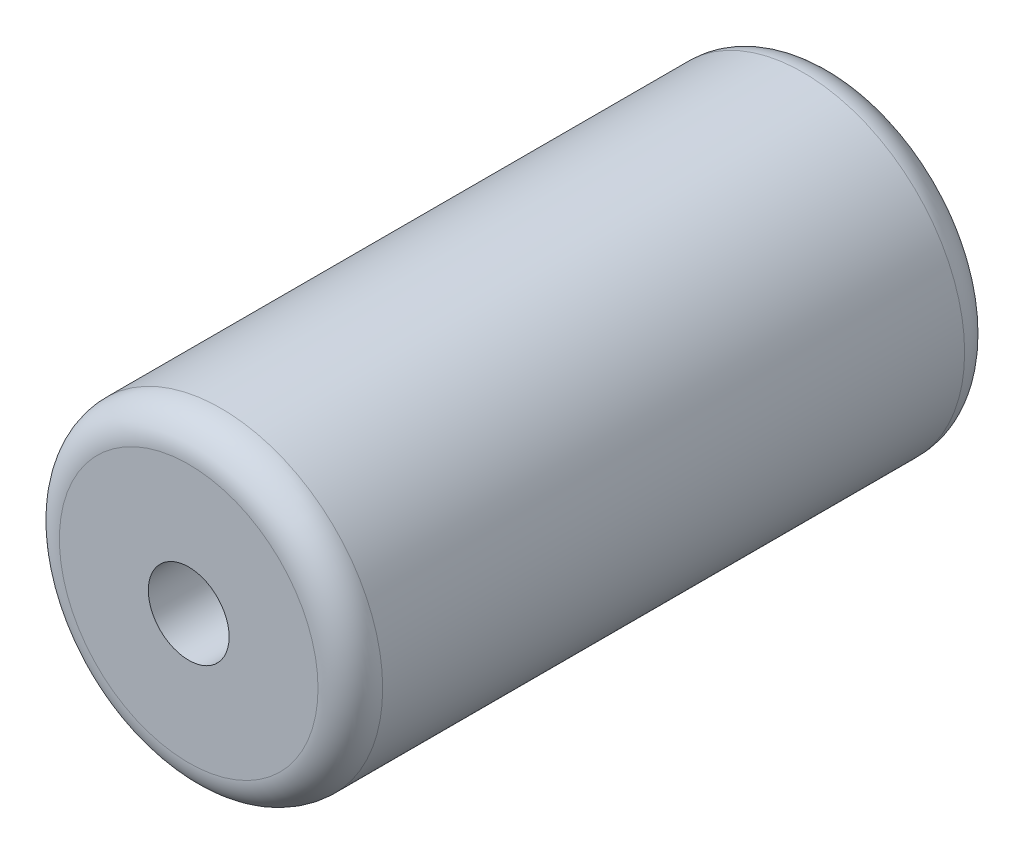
ISO-10303-21;
HEADER;
FILE_DESCRIPTION(('STEP AP214'),'2;1');
FILE_NAME('part.step','',(''),(''),'','','');
FILE_SCHEMA(('AUTOMOTIVE_DESIGN { 1 0 10303 214 1 1 1 1 }'));
ENDSEC;
DATA;
#1=APPLICATION_CONTEXT('core data for automotive mechanical design processes');
#2=APPLICATION_PROTOCOL_DEFINITION('international standard','automotive_design',2000,#1);
#3=PRODUCT_CONTEXT('',#1,'mechanical');
#4=PRODUCT('Part','Part','',(#3));
#5=PRODUCT_RELATED_PRODUCT_CATEGORY('part','',(#4));
#6=PRODUCT_DEFINITION_FORMATION('','',#4);
#7=PRODUCT_DEFINITION_CONTEXT('part definition',#1,'design');
#8=PRODUCT_DEFINITION('design','',#6,#7);
#9=PRODUCT_DEFINITION_SHAPE('','',#8);
#10=(LENGTH_UNIT() NAMED_UNIT(*) SI_UNIT(.MILLI.,.METRE.));
#11=(NAMED_UNIT(*) PLANE_ANGLE_UNIT() SI_UNIT($,.RADIAN.));
#12=(NAMED_UNIT(*) SI_UNIT($,.STERADIAN.) SOLID_ANGLE_UNIT());
#13=UNCERTAINTY_MEASURE_WITH_UNIT(LENGTH_MEASURE(1.E-05),#10,'distance_accuracy_value','');
#14=(GEOMETRIC_REPRESENTATION_CONTEXT(3) GLOBAL_UNCERTAINTY_ASSIGNED_CONTEXT((#13)) GLOBAL_UNIT_ASSIGNED_CONTEXT((#10,
#11,#12)) REPRESENTATION_CONTEXT('',''));
#15=CARTESIAN_POINT('',(0.,0.,0.));
#16=DIRECTION('',(0.,0.,1.));
#17=DIRECTION('',(1.,0.,0.));
#18=AXIS2_PLACEMENT_3D('',#15,#16,#17);
#19=CARTESIAN_POINT('',(0.,0.,50.8));
#20=DIRECTION('',(0.,0.,1.));
#21=DIRECTION('',(1.,0.,0.));
#22=AXIS2_PLACEMENT_3D('',#19,#20,#21);
#23=PLANE('',#22);
#24=CARTESIAN_POINT('',(0.,0.,50.8));
#25=DIRECTION('',(0.,0.,1.));
#26=DIRECTION('',(1.,0.,0.));
#27=AXIS2_PLACEMENT_3D('',#24,#25,#26);
#28=CIRCLE('',#27,10.16);
#29=CARTESIAN_POINT('',(10.16,0.,50.8));
#30=VERTEX_POINT('',#29);
#31=EDGE_CURVE('E59',#30,#30,#28,.T.);
#32=ORIENTED_EDGE('',*,*,#31,.T.);
#33=EDGE_LOOP('',(#32));
#34=FACE_BOUND('',#33,.T.);
#35=CARTESIAN_POINT('',(0.,0.,50.8));
#36=DIRECTION('',(0.,0.,1.));
#37=DIRECTION('',(1.,0.,0.));
#38=AXIS2_PLACEMENT_3D('',#35,#36,#37);
#39=CIRCLE('',#38,3.175);
#40=CARTESIAN_POINT('',(3.175,0.,50.8));
#41=VERTEX_POINT('',#40);
#42=EDGE_CURVE('E64',#41,#41,#39,.T.);
#43=ORIENTED_EDGE('',*,*,#42,.F.);
#44=EDGE_LOOP('',(#43));
#45=FACE_BOUND('',#44,.T.);
#46=ADVANCED_FACE('F44',(#34,#45),#23,.T.);
#47=CARTESIAN_POINT('',(0.,0.,0.));
#48=DIRECTION('',(0.,0.,1.));
#49=DIRECTION('',(1.,0.,0.));
#50=AXIS2_PLACEMENT_3D('',#47,#48,#49);
#51=PLANE('',#50);
#52=CARTESIAN_POINT('',(0.,0.,0.));
#53=DIRECTION('',(0.,0.,1.));
#54=DIRECTION('',(1.,0.,0.));
#55=AXIS2_PLACEMENT_3D('',#52,#53,#54);
#56=CIRCLE('',#55,10.16);
#57=CARTESIAN_POINT('',(10.16,0.,0.));
#58=VERTEX_POINT('',#57);
#59=EDGE_CURVE('E12',#58,#58,#56,.F.);
#60=ORIENTED_EDGE('',*,*,#59,.T.);
#61=EDGE_LOOP('',(#60));
#62=FACE_BOUND('',#61,.T.);
#63=CARTESIAN_POINT('',(0.,0.,0.));
#64=DIRECTION('',(0.,0.,1.));
#65=DIRECTION('',(1.,0.,0.));
#66=AXIS2_PLACEMENT_3D('',#63,#64,#65);
#67=CIRCLE('',#66,3.175);
#68=CARTESIAN_POINT('',(3.175,0.,0.));
#69=VERTEX_POINT('',#68);
#70=EDGE_CURVE('E65',#69,#69,#67,.T.);
#71=ORIENTED_EDGE('',*,*,#70,.T.);
#72=EDGE_LOOP('',(#71));
#73=FACE_BOUND('',#72,.T.);
#74=ADVANCED_FACE('F75',(#62,#73),#51,.F.);
#75=CARTESIAN_POINT('',(0.,0.,50.8));
#76=DIRECTION('',(0.,0.,-1.));
#77=DIRECTION('',(-1.,0.,0.));
#78=AXIS2_PLACEMENT_3D('',#75,#76,#77);
#79=CYLINDRICAL_SURFACE('',#78,12.7);
#80=CARTESIAN_POINT('',(0.,0.,48.26));
#81=DIRECTION('',(0.,0.,1.));
#82=DIRECTION('',(1.,0.,0.));
#83=AXIS2_PLACEMENT_3D('',#80,#81,#82);
#84=CIRCLE('',#83,12.7);
#85=CARTESIAN_POINT('',(12.7,0.,48.26));
#86=VERTEX_POINT('',#85);
#87=EDGE_CURVE('E51',#86,#86,#84,.F.);
#88=ORIENTED_EDGE('',*,*,#87,.T.);
#89=EDGE_LOOP('',(#88));
#90=FACE_BOUND('',#89,.T.);
#91=CARTESIAN_POINT('',(0.,0.,2.54));
#92=DIRECTION('',(0.,0.,1.));
#93=DIRECTION('',(1.,0.,0.));
#94=AXIS2_PLACEMENT_3D('',#91,#92,#93);
#95=CIRCLE('',#94,12.7);
#96=CARTESIAN_POINT('',(12.7,0.,2.54));
#97=VERTEX_POINT('',#96);
#98=EDGE_CURVE('E55',#97,#97,#95,.T.);
#99=ORIENTED_EDGE('',*,*,#98,.T.);
#100=EDGE_LOOP('',(#99));
#101=FACE_BOUND('',#100,.T.);
#102=ADVANCED_FACE('F81',(#90,#101),#79,.T.);
#103=CARTESIAN_POINT('',(0.,0.,50.8));
#104=DIRECTION('',(0.,0.,-1.));
#105=DIRECTION('',(-1.,0.,0.));
#106=AXIS2_PLACEMENT_3D('',#103,#104,#105);
#107=CYLINDRICAL_SURFACE('',#106,3.175);
#108=ORIENTED_EDGE('',*,*,#42,.T.);
#109=EDGE_LOOP('',(#108));
#110=FACE_BOUND('',#109,.T.);
#111=ORIENTED_EDGE('',*,*,#70,.F.);
#112=EDGE_LOOP('',(#111));
#113=FACE_BOUND('',#112,.T.);
#114=ADVANCED_FACE('F71',(#110,#113),#107,.F.);
#115=CARTESIAN_POINT('',(0.,0.,48.26));
#116=DIRECTION('',(0.,0.,1.));
#117=DIRECTION('',(1.,0.,0.));
#118=AXIS2_PLACEMENT_3D('',#115,#116,#117);
#119=TOROIDAL_SURFACE('',#118,10.16,2.54);
#120=ORIENTED_EDGE('',*,*,#87,.F.);
#121=EDGE_LOOP('',(#120));
#122=FACE_BOUND('',#121,.T.);
#123=ORIENTED_EDGE('',*,*,#31,.F.);
#124=EDGE_LOOP('',(#123));
#125=FACE_BOUND('',#124,.T.);
#126=ADVANCED_FACE('F86',(#122,#125),#119,.T.);
#127=CARTESIAN_POINT('',(0.,0.,2.54));
#128=DIRECTION('',(0.,0.,1.));
#129=DIRECTION('',(1.,0.,0.));
#130=AXIS2_PLACEMENT_3D('',#127,#128,#129);
#131=TOROIDAL_SURFACE('',#130,10.16,2.54);
#132=ORIENTED_EDGE('',*,*,#59,.F.);
#133=EDGE_LOOP('',(#132));
#134=FACE_BOUND('',#133,.T.);
#135=ORIENTED_EDGE('',*,*,#98,.F.);
#136=EDGE_LOOP('',(#135));
#137=FACE_BOUND('',#136,.T.);
#138=ADVANCED_FACE('F46',(#134,#137),#131,.T.);
#139=CLOSED_SHELL('',(#46,#74,#102,#114,#126,#138));
#140=MANIFOLD_SOLID_BREP('B2',#139);
#141=ADVANCED_BREP_SHAPE_REPRESENTATION('',(#18,#140),#14);
#142=SHAPE_DEFINITION_REPRESENTATION(#9,#141);
ENDSEC;
END-ISO-10303-21;
